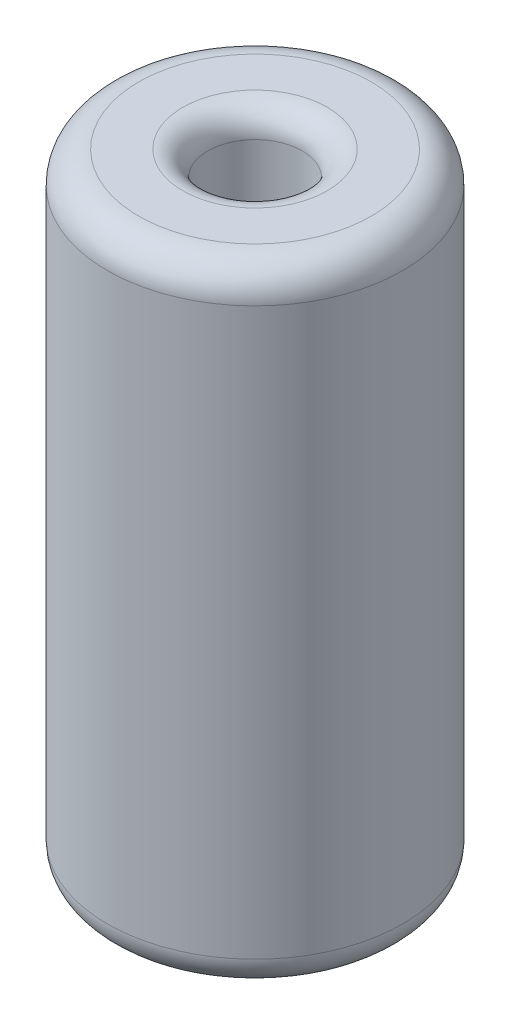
from build123d import *


with BuildPart() as part:
    # Sketch1 → Revolve1 (revolve)
    with BuildSketch(Plane.XY, mode=Mode.PRIVATE) as revolve1_sk:
        with BuildLine():
            Line((1.15, 10), (1.85, 10))
            ThreePointArc((1.85, 10), (2.203553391, 9.853553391), (2.35, 9.5))
            Line((2.35, 9.5), (2.35, 0.5))
            ThreePointArc((2.35, 0.5), (2.203553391, 0.146446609), (1.85, 0))
            Line((1.85, 0), (1.15, 0))
            ThreePointArc((1.15, 0), (0.867157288, 0.117157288), (0.75, 0.4))
            Line((0.75, 0.4), (0.75, 9.6))
            ThreePointArc((0.75, 9.6), (0.867157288, 9.882842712), (1.15, 10))
        make_face()
    revolve(revolve1_sk.sketch.rotate(Axis((0, 0, 0), (0, 1, 0)), 90), axis=Axis((0, 0, 0), (0, 1, 0)))


solid = part.part
